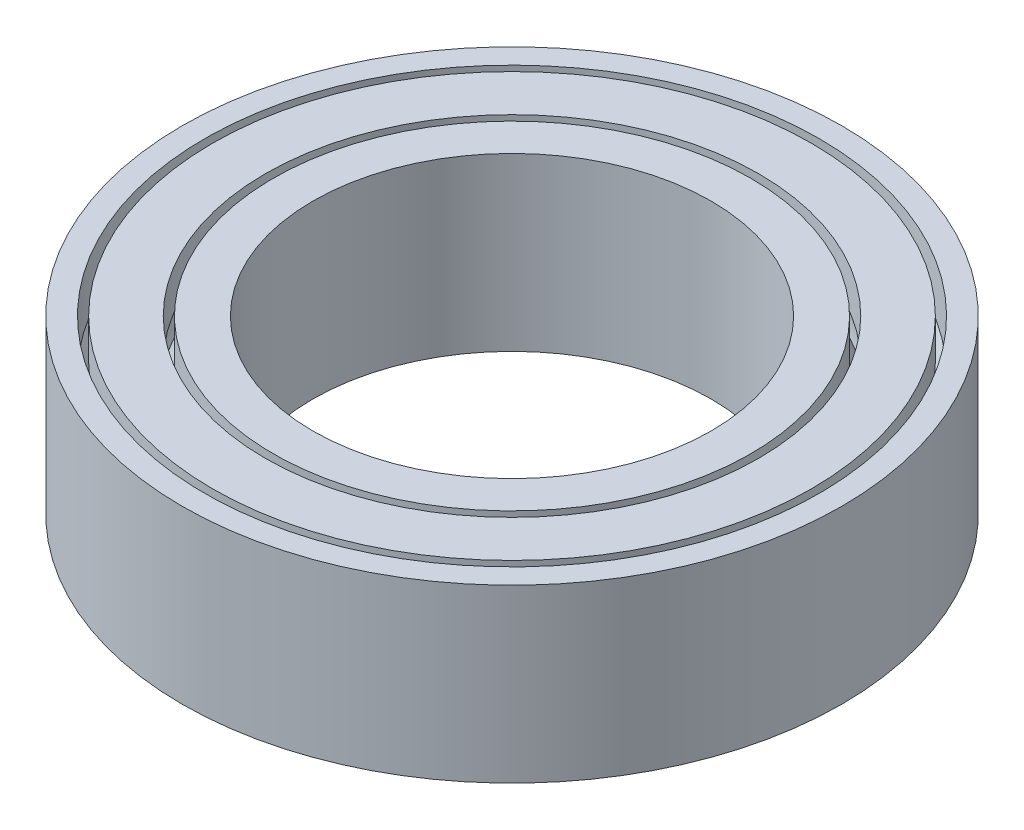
ISO-10303-21;
HEADER;
FILE_DESCRIPTION(('STEP AP214'),'2;1');
FILE_NAME('part.step','',(''),(''),'','','');
FILE_SCHEMA(('AUTOMOTIVE_DESIGN { 1 0 10303 214 1 1 1 1 }'));
ENDSEC;
DATA;
#1=APPLICATION_CONTEXT('core data for automotive mechanical design processes');
#2=APPLICATION_PROTOCOL_DEFINITION('international standard','automotive_design',2000,#1);
#3=PRODUCT_CONTEXT('',#1,'mechanical');
#4=PRODUCT('Part','Part','',(#3));
#5=PRODUCT_RELATED_PRODUCT_CATEGORY('part','',(#4));
#6=PRODUCT_DEFINITION_FORMATION('','',#4);
#7=PRODUCT_DEFINITION_CONTEXT('part definition',#1,'design');
#8=PRODUCT_DEFINITION('design','',#6,#7);
#9=PRODUCT_DEFINITION_SHAPE('','',#8);
#10=(LENGTH_UNIT() NAMED_UNIT(*) SI_UNIT(.MILLI.,.METRE.));
#11=(NAMED_UNIT(*) PLANE_ANGLE_UNIT() SI_UNIT($,.RADIAN.));
#12=(NAMED_UNIT(*) SI_UNIT($,.STERADIAN.) SOLID_ANGLE_UNIT());
#13=UNCERTAINTY_MEASURE_WITH_UNIT(LENGTH_MEASURE(1.E-05),#10,'distance_accuracy_value','');
#14=(GEOMETRIC_REPRESENTATION_CONTEXT(3) GLOBAL_UNCERTAINTY_ASSIGNED_CONTEXT((#13)) GLOBAL_UNIT_ASSIGNED_CONTEXT((#10,
#11,#12)) REPRESENTATION_CONTEXT('',''));
#15=CARTESIAN_POINT('',(0.,0.,0.));
#16=DIRECTION('',(0.,0.,1.));
#17=DIRECTION('',(1.,0.,0.));
#18=AXIS2_PLACEMENT_3D('',#15,#16,#17);
#19=CARTESIAN_POINT('',(0.,0.,0.));
#20=DIRECTION('',(0.,-1.,0.));
#21=DIRECTION('',(0.,0.,-1.));
#22=AXIS2_PLACEMENT_3D('',#19,#20,#21);
#23=CYLINDRICAL_SURFACE('',#22,11.65);
#24=CARTESIAN_POINT('',(-1.11022302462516E-13,-3.24999999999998,8.88178419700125E-13));
#25=DIRECTION('',(0.,-1.,0.));
#26=DIRECTION('',(0.,0.,-1.));
#27=AXIS2_PLACEMENT_3D('',#24,#25,#26);
#28=CIRCLE('',#27,11.65);
#29=CARTESIAN_POINT('',(-1.10375597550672E-13,-3.24999999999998,-11.6499999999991));
#30=VERTEX_POINT('',#29);
#31=EDGE_CURVE('E11',#30,#30,#28,.T.);
#32=ORIENTED_EDGE('',*,*,#31,.T.);
#33=EDGE_LOOP('',(#32));
#34=FACE_BOUND('',#33,.T.);
#35=CARTESIAN_POINT('',(0.,-1.32287565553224,0.));
#36=DIRECTION('',(0.,-1.,0.));
#37=DIRECTION('',(0.,0.,-1.));
#38=AXIS2_PLACEMENT_3D('',#35,#36,#37);
#39=CIRCLE('',#38,11.65);
#40=CARTESIAN_POINT('',(0.,-1.32287565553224,-11.65));
#41=VERTEX_POINT('',#40);
#42=EDGE_CURVE('E83',#41,#41,#39,.T.);
#43=ORIENTED_EDGE('',*,*,#42,.F.);
#44=EDGE_LOOP('',(#43));
#45=FACE_BOUND('',#44,.T.);
#46=ADVANCED_FACE('F54',(#34,#45),#23,.F.);
#47=CARTESIAN_POINT('',(11.6500000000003,-3.24999999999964,8.88178419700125E-13));
#48=DIRECTION('',(0.,-1.,0.));
#49=DIRECTION('',(0.,0.,-1.));
#50=AXIS2_PLACEMENT_3D('',#47,#48,#49);
#51=PLANE('',#50);
#52=CARTESIAN_POINT('',(-1.11022302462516E-13,-3.24999999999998,8.88178419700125E-13));
#53=DIRECTION('',(0.,-1.,0.));
#54=DIRECTION('',(0.,0.,-1.));
#55=AXIS2_PLACEMENT_3D('',#52,#53,#54);
#56=CIRCLE('',#55,12.5);
#57=CARTESIAN_POINT('',(-1.10328413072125E-13,-3.24999999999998,-12.4999999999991));
#58=VERTEX_POINT('',#57);
#59=EDGE_CURVE('E61',#58,#58,#56,.T.);
#60=ORIENTED_EDGE('',*,*,#59,.T.);
#61=EDGE_LOOP('',(#60));
#62=FACE_BOUND('',#61,.T.);
#63=ORIENTED_EDGE('',*,*,#31,.F.);
#64=EDGE_LOOP('',(#63));
#65=FACE_BOUND('',#64,.T.);
#66=ADVANCED_FACE('F93',(#62,#65),#51,.T.);
#67=CARTESIAN_POINT('',(0.,0.,0.));
#68=DIRECTION('',(0.,-1.,0.));
#69=DIRECTION('',(0.,0.,-1.));
#70=AXIS2_PLACEMENT_3D('',#67,#68,#69);
#71=CYLINDRICAL_SURFACE('',#70,12.5);
#72=CARTESIAN_POINT('',(2.22044604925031E-13,3.24999999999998,4.44089209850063E-13));
#73=DIRECTION('',(0.,-1.,0.));
#74=DIRECTION('',(0.,0.,-1.));
#75=AXIS2_PLACEMENT_3D('',#72,#73,#74);
#76=CIRCLE('',#75,12.5);
#77=CARTESIAN_POINT('',(2.22738494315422E-13,3.24999999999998,-12.4999999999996));
#78=VERTEX_POINT('',#77);
#79=EDGE_CURVE('E67',#78,#78,#76,.T.);
#80=ORIENTED_EDGE('',*,*,#79,.T.);
#81=EDGE_LOOP('',(#80));
#82=FACE_BOUND('',#81,.T.);
#83=ORIENTED_EDGE('',*,*,#59,.F.);
#84=EDGE_LOOP('',(#83));
#85=FACE_BOUND('',#84,.T.);
#86=ADVANCED_FACE('F97',(#82,#85),#71,.T.);
#87=CARTESIAN_POINT('',(12.5000000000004,3.25000000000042,4.44089209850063E-13));
#88=DIRECTION('',(0.,1.,0.));
#89=DIRECTION('',(0.,0.,1.));
#90=AXIS2_PLACEMENT_3D('',#87,#88,#89);
#91=PLANE('',#90);
#92=CARTESIAN_POINT('',(2.22044604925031E-13,3.24999999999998,4.44089209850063E-13));
#93=DIRECTION('',(0.,-1.,0.));
#94=DIRECTION('',(0.,0.,-1.));
#95=AXIS2_PLACEMENT_3D('',#92,#93,#94);
#96=CIRCLE('',#95,11.65);
#97=CARTESIAN_POINT('',(2.22691309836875E-13,3.24999999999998,-11.6499999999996));
#98=VERTEX_POINT('',#97);
#99=EDGE_CURVE('E73',#98,#98,#96,.T.);
#100=ORIENTED_EDGE('',*,*,#99,.T.);
#101=EDGE_LOOP('',(#100));
#102=FACE_BOUND('',#101,.T.);
#103=ORIENTED_EDGE('',*,*,#79,.F.);
#104=EDGE_LOOP('',(#103));
#105=FACE_BOUND('',#104,.T.);
#106=ADVANCED_FACE('F101',(#102,#105),#91,.T.);
#107=CARTESIAN_POINT('',(0.,0.,0.));
#108=DIRECTION('',(0.,-1.,0.));
#109=DIRECTION('',(0.,0.,-1.));
#110=AXIS2_PLACEMENT_3D('',#107,#108,#109);
#111=CYLINDRICAL_SURFACE('',#110,11.65);
#112=CARTESIAN_POINT('',(0.,1.32287565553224,0.));
#113=DIRECTION('',(0.,-1.,0.));
#114=DIRECTION('',(0.,0.,-1.));
#115=AXIS2_PLACEMENT_3D('',#112,#113,#114);
#116=CIRCLE('',#115,11.65);
#117=CARTESIAN_POINT('',(0.,1.32287565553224,-11.65));
#118=VERTEX_POINT('',#117);
#119=EDGE_CURVE('E79',#118,#118,#116,.T.);
#120=ORIENTED_EDGE('',*,*,#119,.T.);
#121=EDGE_LOOP('',(#120));
#122=FACE_BOUND('',#121,.T.);
#123=ORIENTED_EDGE('',*,*,#99,.F.);
#124=EDGE_LOOP('',(#123));
#125=FACE_BOUND('',#124,.T.);
#126=ADVANCED_FACE('F108',(#122,#125),#111,.F.);
#127=CARTESIAN_POINT('',(0.,0.,0.));
#128=DIRECTION('',(0.,-1.,0.));
#129=DIRECTION('',(0.,0.,-1.));
#130=AXIS2_PLACEMENT_3D('',#127,#128,#129);
#131=TOROIDAL_SURFACE('',#130,13.15,2.);
#132=ORIENTED_EDGE('',*,*,#42,.T.);
#133=EDGE_LOOP('',(#132));
#134=FACE_BOUND('',#133,.T.);
#135=ORIENTED_EDGE('',*,*,#119,.F.);
#136=EDGE_LOOP('',(#135));
#137=FACE_BOUND('',#136,.T.);
#138=ADVANCED_FACE('F89',(#134,#137),#131,.T.);
#139=CLOSED_SHELL('',(#46,#66,#86,#106,#126,#138));
#140=MANIFOLD_SOLID_BREP('B2',#139);
#141=CARTESIAN_POINT('',(0.,0.,0.));
#142=DIRECTION('',(0.,-1.,0.));
#143=DIRECTION('',(0.,0.,-1.));
#144=AXIS2_PLACEMENT_3D('',#141,#142,#143);
#145=CYLINDRICAL_SURFACE('',#144,9.35);
#146=CARTESIAN_POINT('',(0.,1.7386365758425,0.));
#147=DIRECTION('',(0.,-1.,0.));
#148=DIRECTION('',(0.,0.,-1.));
#149=AXIS2_PLACEMENT_3D('',#146,#147,#148);
#150=CIRCLE('',#149,9.35);
#151=CARTESIAN_POINT('',(0.,1.7386365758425,-9.35000000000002));
#152=VERTEX_POINT('',#151);
#153=EDGE_CURVE('E218',#152,#152,#150,.T.);
#154=ORIENTED_EDGE('',*,*,#153,.T.);
#155=EDGE_LOOP('',(#154));
#156=FACE_BOUND('',#155,.T.);
#157=CARTESIAN_POINT('',(2.22044604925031E-13,3.24999999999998,4.44089209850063E-13));
#158=DIRECTION('',(0.,-1.,0.));
#159=DIRECTION('',(0.,0.,-1.));
#160=AXIS2_PLACEMENT_3D('',#157,#158,#159);
#161=CIRCLE('',#160,9.35);
#162=CARTESIAN_POINT('',(2.22563634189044E-13,3.24999999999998,-9.34999999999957));
#163=VERTEX_POINT('',#162);
#164=EDGE_CURVE('E53',#163,#163,#161,.T.);
#165=ORIENTED_EDGE('',*,*,#164,.F.);
#166=EDGE_LOOP('',(#165));
#167=FACE_BOUND('',#166,.T.);
#168=ADVANCED_FACE('F165',(#156,#167),#145,.F.);
#169=CARTESIAN_POINT('',(9.3500000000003,3.25000000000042,6.66133814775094E-13));
#170=DIRECTION('',(0.,1.,0.));
#171=DIRECTION('',(0.,0.,1.));
#172=AXIS2_PLACEMENT_3D('',#169,#170,#171);
#173=PLANE('',#172);
#174=ORIENTED_EDGE('',*,*,#164,.T.);
#175=EDGE_LOOP('',(#174));
#176=FACE_BOUND('',#175,.T.);
#177=CARTESIAN_POINT('',(2.22044604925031E-13,3.24999999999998,4.44089209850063E-13));
#178=DIRECTION('',(0.,-1.,0.));
#179=DIRECTION('',(0.,0.,-1.));
#180=AXIS2_PLACEMENT_3D('',#177,#178,#179);
#181=CIRCLE('',#180,11.35);
#182=CARTESIAN_POINT('',(2.22674656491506E-13,3.24999999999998,-11.3499999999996));
#183=VERTEX_POINT('',#182);
#184=EDGE_CURVE('E172',#183,#183,#181,.T.);
#185=ORIENTED_EDGE('',*,*,#184,.F.);
#186=EDGE_LOOP('',(#185));
#187=FACE_BOUND('',#186,.T.);
#188=ADVANCED_FACE('F238',(#176,#187),#173,.T.);
#189=CARTESIAN_POINT('',(0.,0.,0.));
#190=DIRECTION('',(0.,-1.,0.));
#191=DIRECTION('',(0.,0.,-1.));
#192=AXIS2_PLACEMENT_3D('',#189,#190,#191);
#193=CYLINDRICAL_SURFACE('',#192,11.35);
#194=ORIENTED_EDGE('',*,*,#184,.T.);
#195=EDGE_LOOP('',(#194));
#196=FACE_BOUND('',#195,.T.);
#197=CARTESIAN_POINT('',(0.,1.73863657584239,0.));
#198=DIRECTION('',(0.,-1.,0.));
#199=DIRECTION('',(0.,0.,-1.));
#200=AXIS2_PLACEMENT_3D('',#197,#198,#199);
#201=CIRCLE('',#200,11.35);
#202=CARTESIAN_POINT('',(0.,1.73863657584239,-11.35));
#203=VERTEX_POINT('',#202);
#204=EDGE_CURVE('E178',#203,#203,#201,.T.);
#205=ORIENTED_EDGE('',*,*,#204,.F.);
#206=EDGE_LOOP('',(#205));
#207=FACE_BOUND('',#206,.T.);
#208=ADVANCED_FACE('F242',(#196,#207),#193,.T.);
#209=CARTESIAN_POINT('',(0.,1.65359456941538,0.));
#210=DIRECTION('',(0.,1.,0.));
#211=DIRECTION('',(0.,0.,1.));
#212=AXIS2_PLACEMENT_3D('',#209,#210,#211);
#213=CONICAL_SURFACE('',#212,11.275,0.722734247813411);
#214=ORIENTED_EDGE('',*,*,#204,.T.);
#215=EDGE_LOOP('',(#214));
#216=FACE_BOUND('',#215,.T.);
#217=CARTESIAN_POINT('',(0.,1.65359456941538,0.));
#218=DIRECTION('',(0.,-1.,0.));
#219=DIRECTION('',(0.,0.,-1.));
#220=AXIS2_PLACEMENT_3D('',#217,#218,#219);
#221=CIRCLE('',#220,11.275);
#222=CARTESIAN_POINT('',(0.,1.65359456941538,-11.275));
#223=VERTEX_POINT('',#222);
#224=EDGE_CURVE('E184',#223,#223,#221,.T.);
#225=ORIENTED_EDGE('',*,*,#224,.F.);
#226=EDGE_LOOP('',(#225));
#227=FACE_BOUND('',#226,.T.);
#228=ADVANCED_FACE('F246',(#216,#227),#213,.T.);
#229=CARTESIAN_POINT('',(0.,0.,0.));
#230=DIRECTION('',(0.,-1.,0.));
#231=DIRECTION('',(0.,0.,-1.));
#232=AXIS2_PLACEMENT_3D('',#229,#230,#231);
#233=TOROIDAL_SURFACE('',#232,13.15,2.5);
#234=ORIENTED_EDGE('',*,*,#224,.T.);
#235=EDGE_LOOP('',(#234));
#236=FACE_BOUND('',#235,.T.);
#237=CARTESIAN_POINT('',(-1.11022302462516E-13,-1.65359456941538,8.88178419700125E-13));
#238=DIRECTION('',(0.,-1.,0.));
#239=DIRECTION('',(0.,0.,-1.));
#240=AXIS2_PLACEMENT_3D('',#237,#238,#239);
#241=CIRCLE('',#240,11.275);
#242=CARTESIAN_POINT('',(-1.10396414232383E-13,-1.65359456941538,-11.2749999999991));
#243=VERTEX_POINT('',#242);
#244=EDGE_CURVE('E190',#243,#243,#241,.T.);
#245=ORIENTED_EDGE('',*,*,#244,.F.);
#246=EDGE_LOOP('',(#245));
#247=FACE_BOUND('',#246,.T.);
#248=ADVANCED_FACE('F252',(#236,#247),#233,.F.);
#249=CARTESIAN_POINT('',(-1.11022302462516E-13,-1.73863657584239,8.88178419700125E-13));
#250=DIRECTION('',(0.,-1.,0.));
#251=DIRECTION('',(0.,0.,-1.));
#252=AXIS2_PLACEMENT_3D('',#249,#250,#251);
#253=CONICAL_SURFACE('',#252,11.35,0.72273424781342);
#254=ORIENTED_EDGE('',*,*,#244,.T.);
#255=EDGE_LOOP('',(#254));
#256=FACE_BOUND('',#255,.T.);
#257=CARTESIAN_POINT('',(-1.11022302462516E-13,-1.73863657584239,8.88178419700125E-13));
#258=DIRECTION('',(0.,-1.,0.));
#259=DIRECTION('',(0.,0.,-1.));
#260=AXIS2_PLACEMENT_3D('',#257,#258,#259);
#261=CIRCLE('',#260,11.35);
#262=CARTESIAN_POINT('',(-1.10392250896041E-13,-1.73863657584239,-11.3499999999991));
#263=VERTEX_POINT('',#262);
#264=EDGE_CURVE('E194',#263,#263,#261,.T.);
#265=ORIENTED_EDGE('',*,*,#264,.F.);
#266=EDGE_LOOP('',(#265));
#267=FACE_BOUND('',#266,.T.);
#268=ADVANCED_FACE('F256',(#256,#267),#253,.T.);
#269=CARTESIAN_POINT('',(0.,0.,0.));
#270=DIRECTION('',(0.,-1.,0.));
#271=DIRECTION('',(0.,0.,-1.));
#272=AXIS2_PLACEMENT_3D('',#269,#270,#271);
#273=CYLINDRICAL_SURFACE('',#272,11.35);
#274=ORIENTED_EDGE('',*,*,#264,.T.);
#275=EDGE_LOOP('',(#274));
#276=FACE_BOUND('',#275,.T.);
#277=CARTESIAN_POINT('',(-1.11022302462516E-13,-3.24999999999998,8.88178419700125E-13));
#278=DIRECTION('',(0.,-1.,0.));
#279=DIRECTION('',(0.,0.,-1.));
#280=AXIS2_PLACEMENT_3D('',#277,#278,#279);
#281=CIRCLE('',#280,11.35);
#282=CARTESIAN_POINT('',(-1.10392250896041E-13,-3.24999999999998,-11.3499999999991));
#283=VERTEX_POINT('',#282);
#284=EDGE_CURVE('E198',#283,#283,#281,.T.);
#285=ORIENTED_EDGE('',*,*,#284,.F.);
#286=EDGE_LOOP('',(#285));
#287=FACE_BOUND('',#286,.T.);
#288=ADVANCED_FACE('F260',(#276,#287),#273,.T.);
#289=CARTESIAN_POINT('',(9.35000000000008,-3.24999999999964,6.66133814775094E-13));
#290=DIRECTION('',(0.,-1.,0.));
#291=DIRECTION('',(0.,0.,-1.));
#292=AXIS2_PLACEMENT_3D('',#289,#290,#291);
#293=PLANE('',#292);
#294=ORIENTED_EDGE('',*,*,#284,.T.);
#295=EDGE_LOOP('',(#294));
#296=FACE_BOUND('',#295,.T.);
#297=CARTESIAN_POINT('',(-1.11022302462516E-13,-3.24999999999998,8.88178419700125E-13));
#298=DIRECTION('',(0.,-1.,0.));
#299=DIRECTION('',(0.,0.,-1.));
#300=AXIS2_PLACEMENT_3D('',#297,#298,#299);
#301=CIRCLE('',#300,9.35);
#302=CARTESIAN_POINT('',(-1.10503273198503E-13,-3.24999999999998,-9.34999999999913));
#303=VERTEX_POINT('',#302);
#304=EDGE_CURVE('E202',#303,#303,#301,.T.);
#305=ORIENTED_EDGE('',*,*,#304,.F.);
#306=EDGE_LOOP('',(#305));
#307=FACE_BOUND('',#306,.T.);
#308=ADVANCED_FACE('F264',(#296,#307),#293,.T.);
#309=CARTESIAN_POINT('',(0.,0.,0.));
#310=DIRECTION('',(0.,-1.,0.));
#311=DIRECTION('',(0.,0.,-1.));
#312=AXIS2_PLACEMENT_3D('',#309,#310,#311);
#313=CYLINDRICAL_SURFACE('',#312,9.35);
#314=ORIENTED_EDGE('',*,*,#304,.T.);
#315=EDGE_LOOP('',(#314));
#316=FACE_BOUND('',#315,.T.);
#317=CARTESIAN_POINT('',(-1.11022302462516E-13,-1.7386365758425,8.88178419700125E-13));
#318=DIRECTION('',(0.,-1.,0.));
#319=DIRECTION('',(0.,0.,-1.));
#320=AXIS2_PLACEMENT_3D('',#317,#318,#319);
#321=CIRCLE('',#320,9.35);
#322=CARTESIAN_POINT('',(-1.10503273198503E-13,-1.7386365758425,-9.34999999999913));
#323=VERTEX_POINT('',#322);
#324=EDGE_CURVE('E206',#323,#323,#321,.T.);
#325=ORIENTED_EDGE('',*,*,#324,.F.);
#326=EDGE_LOOP('',(#325));
#327=FACE_BOUND('',#326,.T.);
#328=ADVANCED_FACE('F268',(#316,#327),#313,.F.);
#329=CARTESIAN_POINT('',(-1.11022302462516E-13,-1.65359456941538,8.88178419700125E-13));
#330=DIRECTION('',(0.,1.,0.));
#331=DIRECTION('',(0.,0.,1.));
#332=AXIS2_PLACEMENT_3D('',#329,#330,#331);
#333=CONICAL_SURFACE('',#332,9.425,0.722734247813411);
#334=ORIENTED_EDGE('',*,*,#324,.T.);
#335=EDGE_LOOP('',(#334));
#336=FACE_BOUND('',#335,.T.);
#337=CARTESIAN_POINT('',(-1.11022302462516E-13,-1.65359456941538,8.88178419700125E-13));
#338=DIRECTION('',(0.,-1.,0.));
#339=DIRECTION('',(0.,0.,-1.));
#340=AXIS2_PLACEMENT_3D('',#337,#338,#339);
#341=CIRCLE('',#340,9.425);
#342=CARTESIAN_POINT('',(-1.10499109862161E-13,-1.65359456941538,-9.42499999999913));
#343=VERTEX_POINT('',#342);
#344=EDGE_CURVE('E210',#343,#343,#341,.T.);
#345=ORIENTED_EDGE('',*,*,#344,.F.);
#346=EDGE_LOOP('',(#345));
#347=FACE_BOUND('',#346,.T.);
#348=ADVANCED_FACE('F234',(#336,#347),#333,.F.);
#349=CARTESIAN_POINT('',(0.,0.,0.));
#350=DIRECTION('',(0.,-1.,0.));
#351=DIRECTION('',(0.,0.,-1.));
#352=AXIS2_PLACEMENT_3D('',#349,#350,#351);
#353=TOROIDAL_SURFACE('',#352,7.55,2.5);
#354=ORIENTED_EDGE('',*,*,#344,.T.);
#355=EDGE_LOOP('',(#354));
#356=FACE_BOUND('',#355,.T.);
#357=CARTESIAN_POINT('',(0.,1.65359456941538,0.));
#358=DIRECTION('',(0.,-1.,0.));
#359=DIRECTION('',(0.,0.,-1.));
#360=AXIS2_PLACEMENT_3D('',#357,#358,#359);
#361=CIRCLE('',#360,9.425);
#362=CARTESIAN_POINT('',(0.,1.65359456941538,-9.42500000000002));
#363=VERTEX_POINT('',#362);
#364=EDGE_CURVE('E214',#363,#363,#361,.T.);
#365=ORIENTED_EDGE('',*,*,#364,.F.);
#366=EDGE_LOOP('',(#365));
#367=FACE_BOUND('',#366,.T.);
#368=ADVANCED_FACE('F228',(#356,#367),#353,.F.);
#369=CARTESIAN_POINT('',(0.,1.7386365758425,0.));
#370=DIRECTION('',(0.,-1.,0.));
#371=DIRECTION('',(0.,0.,-1.));
#372=AXIS2_PLACEMENT_3D('',#369,#370,#371);
#373=CONICAL_SURFACE('',#372,9.35,0.722734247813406);
#374=ORIENTED_EDGE('',*,*,#364,.T.);
#375=EDGE_LOOP('',(#374));
#376=FACE_BOUND('',#375,.T.);
#377=ORIENTED_EDGE('',*,*,#153,.F.);
#378=EDGE_LOOP('',(#377));
#379=FACE_BOUND('',#378,.T.);
#380=ADVANCED_FACE('F226',(#376,#379),#373,.F.);
#381=CLOSED_SHELL('',(#168,#188,#208,#228,#248,#268,#288,#308,#328,#348,#368,#380));
#382=MANIFOLD_SOLID_BREP('B6',#381);
#383=CARTESIAN_POINT('',(0.,0.,0.));
#384=DIRECTION('',(0.,-1.,0.));
#385=DIRECTION('',(0.,0.,-1.));
#386=AXIS2_PLACEMENT_3D('',#383,#384,#385);
#387=CYLINDRICAL_SURFACE('',#386,7.55);
#388=CARTESIAN_POINT('',(-1.11022302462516E-13,-3.24999999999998,8.88178419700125E-13));
#389=DIRECTION('',(0.,-1.,0.));
#390=DIRECTION('',(0.,0.,-1.));
#391=AXIS2_PLACEMENT_3D('',#388,#389,#390);
#392=CIRCLE('',#391,7.55);
#393=CARTESIAN_POINT('',(-1.1060319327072E-13,-3.24999999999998,-7.54999999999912));
#394=VERTEX_POINT('',#393);
#395=EDGE_CURVE('E164',#394,#394,#392,.T.);
#396=ORIENTED_EDGE('',*,*,#395,.T.);
#397=EDGE_LOOP('',(#396));
#398=FACE_BOUND('',#397,.T.);
#399=CARTESIAN_POINT('',(2.22044604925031E-13,3.24999999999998,4.44089209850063E-13));
#400=DIRECTION('',(0.,-1.,0.));
#401=DIRECTION('',(0.,0.,-1.));
#402=AXIS2_PLACEMENT_3D('',#399,#400,#401);
#403=CIRCLE('',#402,7.55);
#404=CARTESIAN_POINT('',(2.22463714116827E-13,3.24999999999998,-7.54999999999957));
#405=VERTEX_POINT('',#404);
#406=EDGE_CURVE('E412',#405,#405,#403,.T.);
#407=ORIENTED_EDGE('',*,*,#406,.F.);
#408=EDGE_LOOP('',(#407));
#409=FACE_BOUND('',#408,.T.);
#410=ADVANCED_FACE('F383',(#398,#409),#387,.F.);
#411=CARTESIAN_POINT('',(7.54999999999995,-3.24999999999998,2.22044604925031E-13));
#412=DIRECTION('',(0.,-1.,0.));
#413=DIRECTION('',(0.,0.,-1.));
#414=AXIS2_PLACEMENT_3D('',#411,#412,#413);
#415=PLANE('',#414);
#416=CARTESIAN_POINT('',(-1.11022302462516E-13,-3.24999999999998,8.88178419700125E-13));
#417=DIRECTION('',(0.,-1.,0.));
#418=DIRECTION('',(0.,0.,-1.));
#419=AXIS2_PLACEMENT_3D('',#416,#417,#418);
#420=CIRCLE('',#419,9.05);
#421=CARTESIAN_POINT('',(-1.10519926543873E-13,-3.24999999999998,-9.04999999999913));
#422=VERTEX_POINT('',#421);
#423=EDGE_CURVE('E390',#422,#422,#420,.T.);
#424=ORIENTED_EDGE('',*,*,#423,.T.);
#425=EDGE_LOOP('',(#424));
#426=FACE_BOUND('',#425,.T.);
#427=ORIENTED_EDGE('',*,*,#395,.F.);
#428=EDGE_LOOP('',(#427));
#429=FACE_BOUND('',#428,.T.);
#430=ADVANCED_FACE('F422',(#426,#429),#415,.T.);
#431=CARTESIAN_POINT('',(0.,0.,0.));
#432=DIRECTION('',(0.,-1.,0.));
#433=DIRECTION('',(0.,0.,-1.));
#434=AXIS2_PLACEMENT_3D('',#431,#432,#433);
#435=CYLINDRICAL_SURFACE('',#434,9.05);
#436=CARTESIAN_POINT('',(0.,-1.32287565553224,0.));
#437=DIRECTION('',(0.,-1.,0.));
#438=DIRECTION('',(0.,0.,-1.));
#439=AXIS2_PLACEMENT_3D('',#436,#437,#438);
#440=CIRCLE('',#439,9.05);
#441=CARTESIAN_POINT('',(0.,-1.32287565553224,-9.05000000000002));
#442=VERTEX_POINT('',#441);
#443=EDGE_CURVE('E396',#442,#442,#440,.T.);
#444=ORIENTED_EDGE('',*,*,#443,.T.);
#445=EDGE_LOOP('',(#444));
#446=FACE_BOUND('',#445,.T.);
#447=ORIENTED_EDGE('',*,*,#423,.F.);
#448=EDGE_LOOP('',(#447));
#449=FACE_BOUND('',#448,.T.);
#450=ADVANCED_FACE('F426',(#446,#449),#435,.T.);
#451=CARTESIAN_POINT('',(0.,0.,0.));
#452=DIRECTION('',(0.,-1.,0.));
#453=DIRECTION('',(0.,0.,-1.));
#454=AXIS2_PLACEMENT_3D('',#451,#452,#453);
#455=TOROIDAL_SURFACE('',#454,7.55,2.);
#456=CARTESIAN_POINT('',(0.,1.32287565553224,0.));
#457=DIRECTION('',(0.,-1.,0.));
#458=DIRECTION('',(0.,0.,-1.));
#459=AXIS2_PLACEMENT_3D('',#456,#457,#458);
#460=CIRCLE('',#459,9.05);
#461=CARTESIAN_POINT('',(0.,1.32287565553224,-9.05000000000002));
#462=VERTEX_POINT('',#461);
#463=EDGE_CURVE('E402',#462,#462,#460,.T.);
#464=ORIENTED_EDGE('',*,*,#463,.T.);
#465=EDGE_LOOP('',(#464));
#466=FACE_BOUND('',#465,.T.);
#467=ORIENTED_EDGE('',*,*,#443,.F.);
#468=EDGE_LOOP('',(#467));
#469=FACE_BOUND('',#468,.T.);
#470=ADVANCED_FACE('F430',(#466,#469),#455,.T.);
#471=CARTESIAN_POINT('',(0.,0.,0.));
#472=DIRECTION('',(0.,-1.,0.));
#473=DIRECTION('',(0.,0.,-1.));
#474=AXIS2_PLACEMENT_3D('',#471,#472,#473);
#475=CYLINDRICAL_SURFACE('',#474,9.05);
#476=CARTESIAN_POINT('',(2.22044604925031E-13,3.24999999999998,4.44089209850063E-13));
#477=DIRECTION('',(0.,-1.,0.));
#478=DIRECTION('',(0.,0.,-1.));
#479=AXIS2_PLACEMENT_3D('',#476,#477,#478);
#480=CIRCLE('',#479,9.05);
#481=CARTESIAN_POINT('',(2.22546980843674E-13,3.24999999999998,-9.04999999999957));
#482=VERTEX_POINT('',#481);
#483=EDGE_CURVE('E408',#482,#482,#480,.T.);
#484=ORIENTED_EDGE('',*,*,#483,.T.);
#485=EDGE_LOOP('',(#484));
#486=FACE_BOUND('',#485,.T.);
#487=ORIENTED_EDGE('',*,*,#463,.F.);
#488=EDGE_LOOP('',(#487));
#489=FACE_BOUND('',#488,.T.);
#490=ADVANCED_FACE('F437',(#486,#489),#475,.T.);
#491=CARTESIAN_POINT('',(7.55000000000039,3.25000000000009,4.44089209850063E-13));
#492=DIRECTION('',(0.,1.,0.));
#493=DIRECTION('',(0.,0.,1.));
#494=AXIS2_PLACEMENT_3D('',#491,#492,#493);
#495=PLANE('',#494);
#496=ORIENTED_EDGE('',*,*,#406,.T.);
#497=EDGE_LOOP('',(#496));
#498=FACE_BOUND('',#497,.T.);
#499=ORIENTED_EDGE('',*,*,#483,.F.);
#500=EDGE_LOOP('',(#499));
#501=FACE_BOUND('',#500,.T.);
#502=ADVANCED_FACE('F418',(#498,#501),#495,.T.);
#503=CLOSED_SHELL('',(#410,#430,#450,#470,#490,#502));
#504=MANIFOLD_SOLID_BREP('B48',#503);
#505=ADVANCED_BREP_SHAPE_REPRESENTATION('',(#18,#140,#382,#504),#14);
#506=SHAPE_DEFINITION_REPRESENTATION(#9,#505);
ENDSEC;
END-ISO-10303-21;
